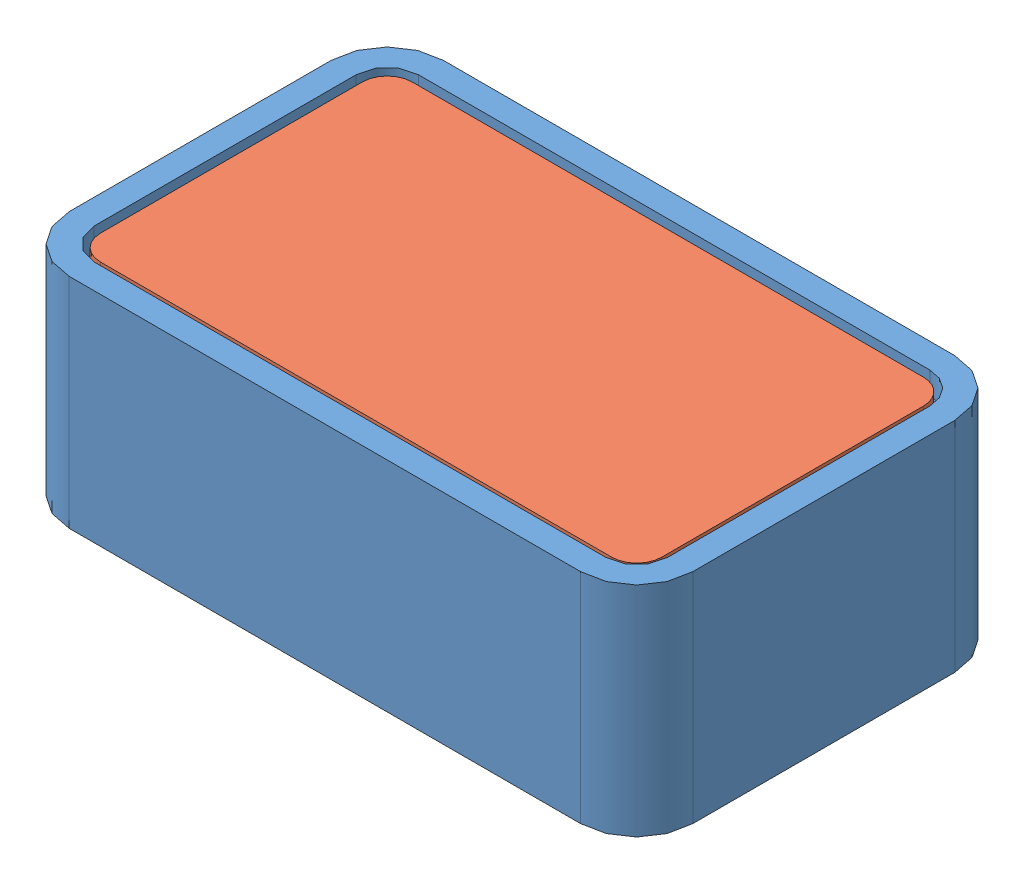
SolidWorks assembly Box-Lid Assembly.SLDASM, configuration Default (file format 3100). Lengths in mm.
Overall size (127 44.45 76.2).
2 component instances, 2 part files, 4 mates.
Components (placement in the parent):
- Box-1: Box.SLDPRT [Default] at origin size (127 44.45 76.2)
- Lid-1: Lid.SLDPRT [Default] at (0 40.005 0) x (-1 0 0) z (0 1 0) size (114.3 63.5 3.81)
Mates (geometry in assembly coordinates):
- InPlace1: in place: plane of Box-1 through (115.57 40.005 -11.43) normal (0 1 0); plane of Lid-1; moOrthogonalPlaneRef_w of Box-1; plane of Lid-1; moOrthogonalPlaneRef_w of Box-1; plane of Lid-1
- Coincident1: coincident aligned: plane of Box-1; plane of Lid-1
- Coincident2: coincident aligned: moOrthogonalPlaneRef_w of Box-1; plane of Lid-1
- Coincident3: coincident anti-aligned: moOrthogonalPlaneRef_w of Box-1; plane of Lid-1
